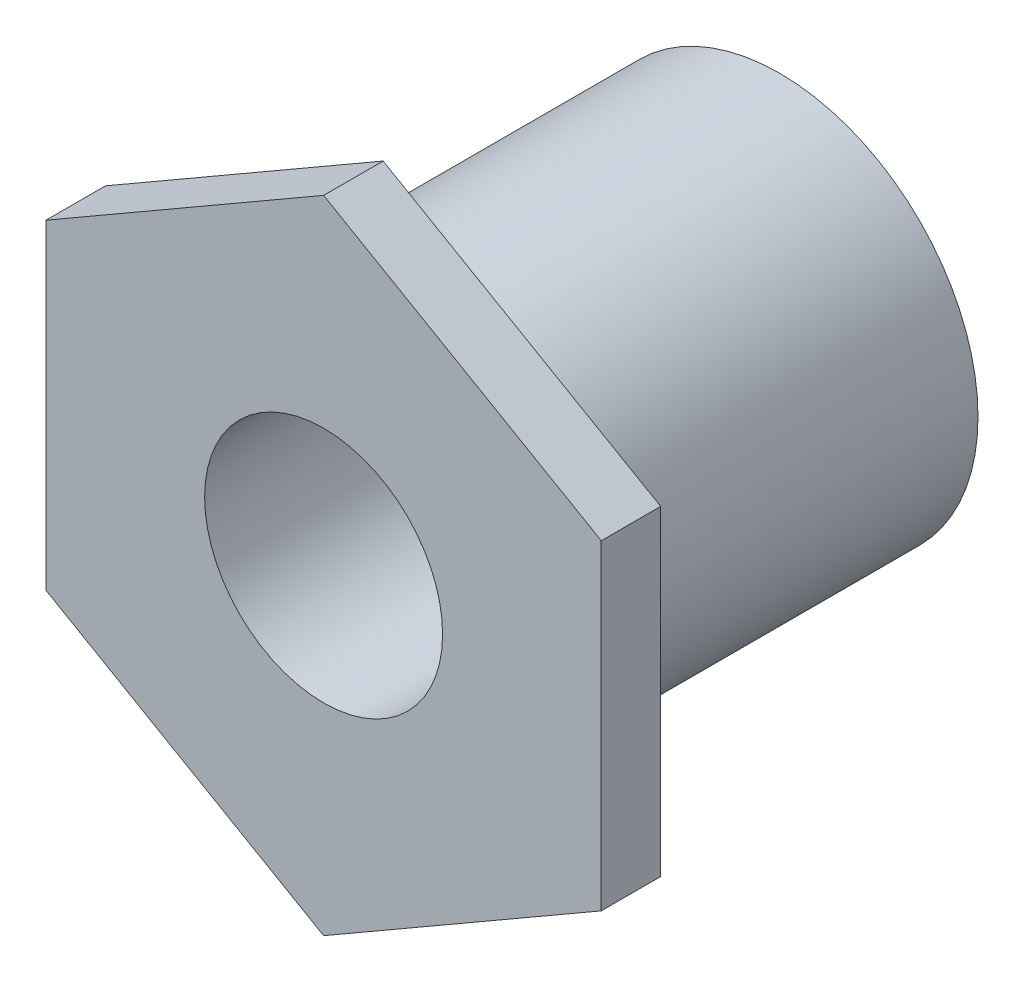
ISO-10303-21;
HEADER;
FILE_DESCRIPTION(('STEP AP214'),'2;1');
FILE_NAME('part.step','',(''),(''),'','','');
FILE_SCHEMA(('AUTOMOTIVE_DESIGN { 1 0 10303 214 1 1 1 1 }'));
ENDSEC;
DATA;
#1=APPLICATION_CONTEXT('core data for automotive mechanical design processes');
#2=APPLICATION_PROTOCOL_DEFINITION('international standard','automotive_design',2000,#1);
#3=PRODUCT_CONTEXT('',#1,'mechanical');
#4=PRODUCT('Part','Part','',(#3));
#5=PRODUCT_RELATED_PRODUCT_CATEGORY('part','',(#4));
#6=PRODUCT_DEFINITION_FORMATION('','',#4);
#7=PRODUCT_DEFINITION_CONTEXT('part definition',#1,'design');
#8=PRODUCT_DEFINITION('design','',#6,#7);
#9=PRODUCT_DEFINITION_SHAPE('','',#8);
#10=(LENGTH_UNIT() NAMED_UNIT(*) SI_UNIT(.MILLI.,.METRE.));
#11=(NAMED_UNIT(*) PLANE_ANGLE_UNIT() SI_UNIT($,.RADIAN.));
#12=(NAMED_UNIT(*) SI_UNIT($,.STERADIAN.) SOLID_ANGLE_UNIT());
#13=UNCERTAINTY_MEASURE_WITH_UNIT(LENGTH_MEASURE(1.E-05),#10,'distance_accuracy_value','');
#14=(GEOMETRIC_REPRESENTATION_CONTEXT(3) GLOBAL_UNCERTAINTY_ASSIGNED_CONTEXT((#13)) GLOBAL_UNIT_ASSIGNED_CONTEXT((#10,
#11,#12)) REPRESENTATION_CONTEXT('',''));
#15=CARTESIAN_POINT('',(0.,0.,0.));
#16=DIRECTION('',(0.,0.,1.));
#17=DIRECTION('',(1.,0.,0.));
#18=AXIS2_PLACEMENT_3D('',#15,#16,#17);
#19=CARTESIAN_POINT('',(0.,0.,1.5));
#20=DIRECTION('',(0.,0.,-1.));
#21=DIRECTION('',(0.,1.,0.));
#22=AXIS2_PLACEMENT_3D('',#19,#20,#21);
#23=CYLINDRICAL_SURFACE('',#22,5.);
#24=CARTESIAN_POINT('',(0.,0.,0.));
#25=DIRECTION('',(0.,0.,-1.));
#26=DIRECTION('',(0.,1.,0.));
#27=AXIS2_PLACEMENT_3D('',#24,#25,#26);
#28=CIRCLE('',#27,5.);
#29=CARTESIAN_POINT('',(0.,5.,0.));
#30=VERTEX_POINT('',#29);
#31=EDGE_CURVE('E9',#30,#30,#28,.T.);
#32=ORIENTED_EDGE('',*,*,#31,.T.);
#33=EDGE_LOOP('',(#32));
#34=FACE_BOUND('',#33,.T.);
#35=CARTESIAN_POINT('',(0.,0.,-10.));
#36=DIRECTION('',(0.,0.,-1.));
#37=DIRECTION('',(-1.,0.,0.));
#38=AXIS2_PLACEMENT_3D('',#35,#36,#37);
#39=CIRCLE('',#38,5.);
#40=CARTESIAN_POINT('',(-5.,0.,-10.));
#41=VERTEX_POINT('',#40);
#42=EDGE_CURVE('E122',#41,#41,#39,.T.);
#43=ORIENTED_EDGE('',*,*,#42,.F.);
#44=EDGE_LOOP('',(#43));
#45=FACE_BOUND('',#44,.T.);
#46=ADVANCED_FACE('F14',(#34,#45),#23,.T.);
#47=CARTESIAN_POINT('',(0.,0.,-6.));
#48=DIRECTION('',(0.,0.,1.));
#49=DIRECTION('',(0.,-1.,0.));
#50=AXIS2_PLACEMENT_3D('',#47,#48,#49);
#51=CYLINDRICAL_SURFACE('',#50,3.);
#52=CARTESIAN_POINT('',(0.,0.,1.5));
#53=DIRECTION('',(0.,0.,1.));
#54=DIRECTION('',(0.,-1.,0.));
#55=AXIS2_PLACEMENT_3D('',#52,#53,#54);
#56=CIRCLE('',#55,3.);
#57=CARTESIAN_POINT('',(0.,-3.,1.5));
#58=VERTEX_POINT('',#57);
#59=EDGE_CURVE('E81',#58,#58,#56,.T.);
#60=ORIENTED_EDGE('',*,*,#59,.T.);
#61=EDGE_LOOP('',(#60));
#62=FACE_BOUND('',#61,.T.);
#63=CARTESIAN_POINT('',(0.,0.,-10.));
#64=DIRECTION('',(0.,0.,-1.));
#65=DIRECTION('',(-1.,0.,0.));
#66=AXIS2_PLACEMENT_3D('',#63,#64,#65);
#67=CIRCLE('',#66,3.);
#68=CARTESIAN_POINT('',(-3.,0.,-10.));
#69=VERTEX_POINT('',#68);
#70=EDGE_CURVE('E125',#69,#69,#67,.T.);
#71=ORIENTED_EDGE('',*,*,#70,.T.);
#72=EDGE_LOOP('',(#71));
#73=FACE_BOUND('',#72,.T.);
#74=ADVANCED_FACE('F129',(#62,#73),#51,.F.);
#75=CARTESIAN_POINT('',(3.,0.,1.5));
#76=DIRECTION('',(0.,0.,1.));
#77=DIRECTION('',(0.,-1.,0.));
#78=AXIS2_PLACEMENT_3D('',#75,#76,#77);
#79=PLANE('',#78);
#80=ORIENTED_EDGE('',*,*,#59,.F.);
#81=EDGE_LOOP('',(#80));
#82=FACE_BOUND('',#81,.T.);
#83=DIRECTION('',(0.,1.,0.));
#84=VECTOR('',#83,1.);
#85=CARTESIAN_POINT('',(-7.,4.04145188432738,1.5));
#86=LINE('',#85,#84);
#87=CARTESIAN_POINT('',(-7.,-4.04145188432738,1.5));
#88=VERTEX_POINT('',#87);
#89=CARTESIAN_POINT('',(-7.,4.04145188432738,1.5));
#90=VERTEX_POINT('',#89);
#91=EDGE_CURVE('E68',#88,#90,#86,.T.);
#92=ORIENTED_EDGE('',*,*,#91,.F.);
#93=DIRECTION('',(-0.866025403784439,0.5,0.));
#94=VECTOR('',#93,1.);
#95=CARTESIAN_POINT('',(-7.,-4.04145188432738,1.5));
#96=LINE('',#95,#94);
#97=CARTESIAN_POINT('',(0.,-8.08290376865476,1.5));
#98=VERTEX_POINT('',#97);
#99=EDGE_CURVE('E102',#98,#88,#96,.T.);
#100=ORIENTED_EDGE('',*,*,#99,.F.);
#101=DIRECTION('',(-0.866025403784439,-0.5,0.));
#102=VECTOR('',#101,1.);
#103=CARTESIAN_POINT('',(0.,-8.08290376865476,1.5));
#104=LINE('',#103,#102);
#105=CARTESIAN_POINT('',(7.,-4.04145188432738,1.5));
#106=VERTEX_POINT('',#105);
#107=EDGE_CURVE('E97',#106,#98,#104,.T.);
#108=ORIENTED_EDGE('',*,*,#107,.F.);
#109=DIRECTION('',(0.,-1.,0.));
#110=VECTOR('',#109,1.);
#111=CARTESIAN_POINT('',(7.,-4.04145188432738,1.5));
#112=LINE('',#111,#110);
#113=CARTESIAN_POINT('',(7.,4.04145188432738,1.5));
#114=VERTEX_POINT('',#113);
#115=EDGE_CURVE('E91',#114,#106,#112,.T.);
#116=ORIENTED_EDGE('',*,*,#115,.F.);
#117=DIRECTION('',(0.866025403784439,-0.5,0.));
#118=VECTOR('',#117,1.);
#119=CARTESIAN_POINT('',(7.,4.04145188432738,1.5));
#120=LINE('',#119,#118);
#121=CARTESIAN_POINT('',(0.,8.08290376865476,1.5));
#122=VERTEX_POINT('',#121);
#123=EDGE_CURVE('E64',#122,#114,#120,.T.);
#124=ORIENTED_EDGE('',*,*,#123,.F.);
#125=DIRECTION('',(0.866025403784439,0.5,0.));
#126=VECTOR('',#125,1.);
#127=CARTESIAN_POINT('',(0.,8.08290376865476,1.5));
#128=LINE('',#127,#126);
#129=EDGE_CURVE('E66',#90,#122,#128,.T.);
#130=ORIENTED_EDGE('',*,*,#129,.F.);
#131=EDGE_LOOP('',(#92,#100,#108,#116,#124,#130));
#132=FACE_BOUND('',#131,.T.);
#133=ADVANCED_FACE('F16',(#82,#132),#79,.T.);
#134=CARTESIAN_POINT('',(-7.,4.04145188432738,0.));
#135=DIRECTION('',(-1.,0.,0.));
#136=DIRECTION('',(0.,1.,0.));
#137=AXIS2_PLACEMENT_3D('',#134,#135,#136);
#138=PLANE('',#137);
#139=DIRECTION('',(0.,1.,0.));
#140=VECTOR('',#139,1.);
#141=CARTESIAN_POINT('',(-7.,0.,0.));
#142=LINE('',#141,#140);
#143=CARTESIAN_POINT('',(-7.,-4.04145188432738,0.));
#144=VERTEX_POINT('',#143);
#145=CARTESIAN_POINT('',(-7.,4.04145188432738,0.));
#146=VERTEX_POINT('',#145);
#147=EDGE_CURVE('E106',#144,#146,#142,.T.);
#148=ORIENTED_EDGE('',*,*,#147,.F.);
#149=DIRECTION('',(0.,0.,-1.));
#150=VECTOR('',#149,1.);
#151=CARTESIAN_POINT('',(-7.,-4.04145188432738,0.));
#152=LINE('',#151,#150);
#153=EDGE_CURVE('E79',#88,#144,#152,.T.);
#154=ORIENTED_EDGE('',*,*,#153,.F.);
#155=ORIENTED_EDGE('',*,*,#91,.T.);
#156=DIRECTION('',(0.,0.,-1.));
#157=VECTOR('',#156,1.);
#158=CARTESIAN_POINT('',(-7.,4.04145188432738,0.));
#159=LINE('',#158,#157);
#160=EDGE_CURVE('E73',#146,#90,#159,.F.);
#161=ORIENTED_EDGE('',*,*,#160,.F.);
#162=EDGE_LOOP('',(#148,#154,#155,#161));
#163=FACE_BOUND('',#162,.T.);
#164=ADVANCED_FACE('F76',(#163),#138,.T.);
#165=CARTESIAN_POINT('',(0.,8.08290376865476,0.));
#166=DIRECTION('',(-0.5,0.866025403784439,0.));
#167=DIRECTION('',(0.866025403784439,0.5,0.));
#168=AXIS2_PLACEMENT_3D('',#165,#166,#167);
#169=PLANE('',#168);
#170=DIRECTION('',(0.866025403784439,0.5,0.));
#171=VECTOR('',#170,1.);
#172=CARTESIAN_POINT('',(-7.,4.04145188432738,0.));
#173=LINE('',#172,#171);
#174=CARTESIAN_POINT('',(0.,8.08290376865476,0.));
#175=VERTEX_POINT('',#174);
#176=EDGE_CURVE('E84',#146,#175,#173,.T.);
#177=ORIENTED_EDGE('',*,*,#176,.F.);
#178=ORIENTED_EDGE('',*,*,#160,.T.);
#179=ORIENTED_EDGE('',*,*,#129,.T.);
#180=DIRECTION('',(0.,0.,-1.));
#181=VECTOR('',#180,1.);
#182=CARTESIAN_POINT('',(0.,8.08290376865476,0.));
#183=LINE('',#182,#181);
#184=EDGE_CURVE('E87',#175,#122,#183,.F.);
#185=ORIENTED_EDGE('',*,*,#184,.F.);
#186=EDGE_LOOP('',(#177,#178,#179,#185));
#187=FACE_BOUND('',#186,.T.);
#188=ADVANCED_FACE('F82',(#187),#169,.T.);
#189=CARTESIAN_POINT('',(7.,4.04145188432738,0.));
#190=DIRECTION('',(0.5,0.866025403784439,0.));
#191=DIRECTION('',(0.866025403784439,-0.5,0.));
#192=AXIS2_PLACEMENT_3D('',#189,#190,#191);
#193=PLANE('',#192);
#194=DIRECTION('',(0.866025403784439,-0.5,0.));
#195=VECTOR('',#194,1.);
#196=CARTESIAN_POINT('',(0.,8.08290376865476,0.));
#197=LINE('',#196,#195);
#198=CARTESIAN_POINT('',(7.,4.04145188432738,0.));
#199=VERTEX_POINT('',#198);
#200=EDGE_CURVE('E109',#175,#199,#197,.T.);
#201=ORIENTED_EDGE('',*,*,#200,.F.);
#202=ORIENTED_EDGE('',*,*,#184,.T.);
#203=ORIENTED_EDGE('',*,*,#123,.T.);
#204=DIRECTION('',(0.,0.,-1.));
#205=VECTOR('',#204,1.);
#206=CARTESIAN_POINT('',(7.,4.04145188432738,0.));
#207=LINE('',#206,#205);
#208=EDGE_CURVE('E94',#199,#114,#207,.F.);
#209=ORIENTED_EDGE('',*,*,#208,.F.);
#210=EDGE_LOOP('',(#201,#202,#203,#209));
#211=FACE_BOUND('',#210,.T.);
#212=ADVANCED_FACE('F167',(#211),#193,.T.);
#213=CARTESIAN_POINT('',(7.,-4.04145188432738,0.));
#214=DIRECTION('',(1.,0.,0.));
#215=DIRECTION('',(0.,-1.,0.));
#216=AXIS2_PLACEMENT_3D('',#213,#214,#215);
#217=PLANE('',#216);
#218=DIRECTION('',(0.,1.,0.));
#219=VECTOR('',#218,1.);
#220=CARTESIAN_POINT('',(7.,0.,0.));
#221=LINE('',#220,#219);
#222=CARTESIAN_POINT('',(7.,-4.04145188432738,0.));
#223=VERTEX_POINT('',#222);
#224=EDGE_CURVE('E112',#199,#223,#221,.F.);
#225=ORIENTED_EDGE('',*,*,#224,.F.);
#226=ORIENTED_EDGE('',*,*,#208,.T.);
#227=ORIENTED_EDGE('',*,*,#115,.T.);
#228=DIRECTION('',(0.,0.,-1.));
#229=VECTOR('',#228,1.);
#230=CARTESIAN_POINT('',(7.,-4.04145188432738,0.));
#231=LINE('',#230,#229);
#232=EDGE_CURVE('E99',#223,#106,#231,.F.);
#233=ORIENTED_EDGE('',*,*,#232,.F.);
#234=EDGE_LOOP('',(#225,#226,#227,#233));
#235=FACE_BOUND('',#234,.T.);
#236=ADVANCED_FACE('F164',(#235),#217,.T.);
#237=CARTESIAN_POINT('',(0.,-8.08290376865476,0.));
#238=DIRECTION('',(0.5,-0.866025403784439,0.));
#239=DIRECTION('',(-0.866025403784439,-0.5,0.));
#240=AXIS2_PLACEMENT_3D('',#237,#238,#239);
#241=PLANE('',#240);
#242=DIRECTION('',(-0.866025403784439,-0.5,0.));
#243=VECTOR('',#242,1.);
#244=CARTESIAN_POINT('',(7.,-4.04145188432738,0.));
#245=LINE('',#244,#243);
#246=CARTESIAN_POINT('',(0.,-8.08290376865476,0.));
#247=VERTEX_POINT('',#246);
#248=EDGE_CURVE('E115',#223,#247,#245,.T.);
#249=ORIENTED_EDGE('',*,*,#248,.F.);
#250=ORIENTED_EDGE('',*,*,#232,.T.);
#251=ORIENTED_EDGE('',*,*,#107,.T.);
#252=DIRECTION('',(0.,0.,-1.));
#253=VECTOR('',#252,1.);
#254=CARTESIAN_POINT('',(0.,-8.08290376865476,0.));
#255=LINE('',#254,#253);
#256=EDGE_CURVE('E31',#247,#98,#255,.F.);
#257=ORIENTED_EDGE('',*,*,#256,.F.);
#258=EDGE_LOOP('',(#249,#250,#251,#257));
#259=FACE_BOUND('',#258,.T.);
#260=ADVANCED_FACE('F160',(#259),#241,.T.);
#261=CARTESIAN_POINT('',(-7.,-4.04145188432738,0.));
#262=DIRECTION('',(-0.5,-0.866025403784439,0.));
#263=DIRECTION('',(-0.866025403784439,0.5,0.));
#264=AXIS2_PLACEMENT_3D('',#261,#262,#263);
#265=PLANE('',#264);
#266=DIRECTION('',(-0.866025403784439,0.5,0.));
#267=VECTOR('',#266,1.);
#268=CARTESIAN_POINT('',(0.,-8.08290376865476,0.));
#269=LINE('',#268,#267);
#270=EDGE_CURVE('E23',#247,#144,#269,.T.);
#271=ORIENTED_EDGE('',*,*,#270,.F.);
#272=ORIENTED_EDGE('',*,*,#256,.T.);
#273=ORIENTED_EDGE('',*,*,#99,.T.);
#274=ORIENTED_EDGE('',*,*,#153,.T.);
#275=EDGE_LOOP('',(#271,#272,#273,#274));
#276=FACE_BOUND('',#275,.T.);
#277=ADVANCED_FACE('F141',(#276),#265,.T.);
#278=CARTESIAN_POINT('',(12.,0.,0.));
#279=DIRECTION('',(0.,0.,-1.));
#280=DIRECTION('',(0.,1.,0.));
#281=AXIS2_PLACEMENT_3D('',#278,#279,#280);
#282=PLANE('',#281);
#283=ORIENTED_EDGE('',*,*,#248,.T.);
#284=ORIENTED_EDGE('',*,*,#270,.T.);
#285=ORIENTED_EDGE('',*,*,#147,.T.);
#286=ORIENTED_EDGE('',*,*,#176,.T.);
#287=ORIENTED_EDGE('',*,*,#200,.T.);
#288=ORIENTED_EDGE('',*,*,#224,.T.);
#289=EDGE_LOOP('',(#283,#284,#285,#286,#287,#288));
#290=FACE_BOUND('',#289,.T.);
#291=ORIENTED_EDGE('',*,*,#31,.F.);
#292=EDGE_LOOP('',(#291));
#293=FACE_BOUND('',#292,.T.);
#294=ADVANCED_FACE('F133',(#290,#293),#282,.T.);
#295=CARTESIAN_POINT('',(0.,0.,-10.));
#296=DIRECTION('',(0.,0.,-1.));
#297=DIRECTION('',(-1.,0.,0.));
#298=AXIS2_PLACEMENT_3D('',#295,#296,#297);
#299=PLANE('',#298);
#300=ORIENTED_EDGE('',*,*,#42,.T.);
#301=EDGE_LOOP('',(#300));
#302=FACE_BOUND('',#301,.T.);
#303=ORIENTED_EDGE('',*,*,#70,.F.);
#304=EDGE_LOOP('',(#303));
#305=FACE_BOUND('',#304,.T.);
#306=ADVANCED_FACE('F131',(#302,#305),#299,.T.);
#307=CLOSED_SHELL('',(#46,#74,#133,#164,#188,#212,#236,#260,#277,#294,#306));
#308=MANIFOLD_SOLID_BREP('B1',#307);
#309=ADVANCED_BREP_SHAPE_REPRESENTATION('',(#18,#308),#14);
#310=SHAPE_DEFINITION_REPRESENTATION(#9,#309);
ENDSEC;
END-ISO-10303-21;
